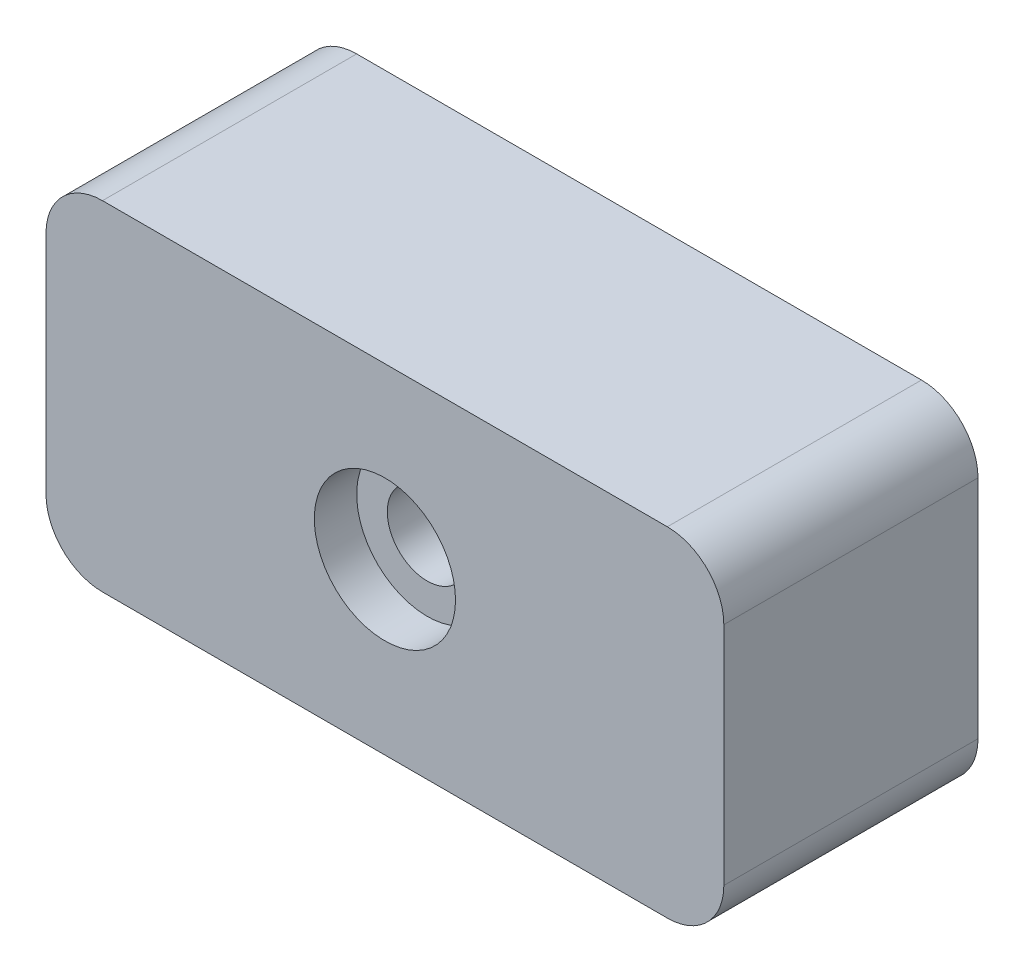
from build123d import *

# Parameters (mm, degrees)
SKETCH2_W                                      = 38.1
SKETCH2_H                                      = 19.05
BOSS_EXTRUDE2_DEPTH                            = 14.2875
CBORE_FOR_8_SOCKET_HEAD_CAP_SCREW1_D           = 4.4958
CBORE_FOR_8_SOCKET_HEAD_CAP_SCREW1_CBORE_D     = 7.9375
CBORE_FOR_8_SOCKET_HEAD_CAP_SCREW1_CBORE_DEPTH = 2.38125
FILLET1_R                                      = 3.175


with BuildPart() as part:
    # Sketch2 → Boss-Extrude2 (new body)
    with BuildSketch(Plane.XY):
        Rectangle(SKETCH2_W, SKETCH2_H)
    extrude(amount=BOSS_EXTRUDE2_DEPTH)

    # CBORE for _8 Socket Head Cap Screw1 (through all)
    with Locations(Plane.XY.offset(14.2875)):
        with Locations((0, 0)):
            CounterBoreHole(CBORE_FOR_8_SOCKET_HEAD_CAP_SCREW1_D / 2, CBORE_FOR_8_SOCKET_HEAD_CAP_SCREW1_CBORE_D / 2, CBORE_FOR_8_SOCKET_HEAD_CAP_SCREW1_CBORE_DEPTH)

    # Fillet1
    fillet1_edges = [part.edges().sort_by_distance(p)[0] for p in [
        (19.05, -9.525, 7.14375),
        (-19.05, -9.525, 7.14375),
        (-19.05, 9.525, 7.14375),
        (19.05, 9.525, 7.14375),
    ]]
    fillet(fillet1_edges, radius=FILLET1_R)


solid = part.part
